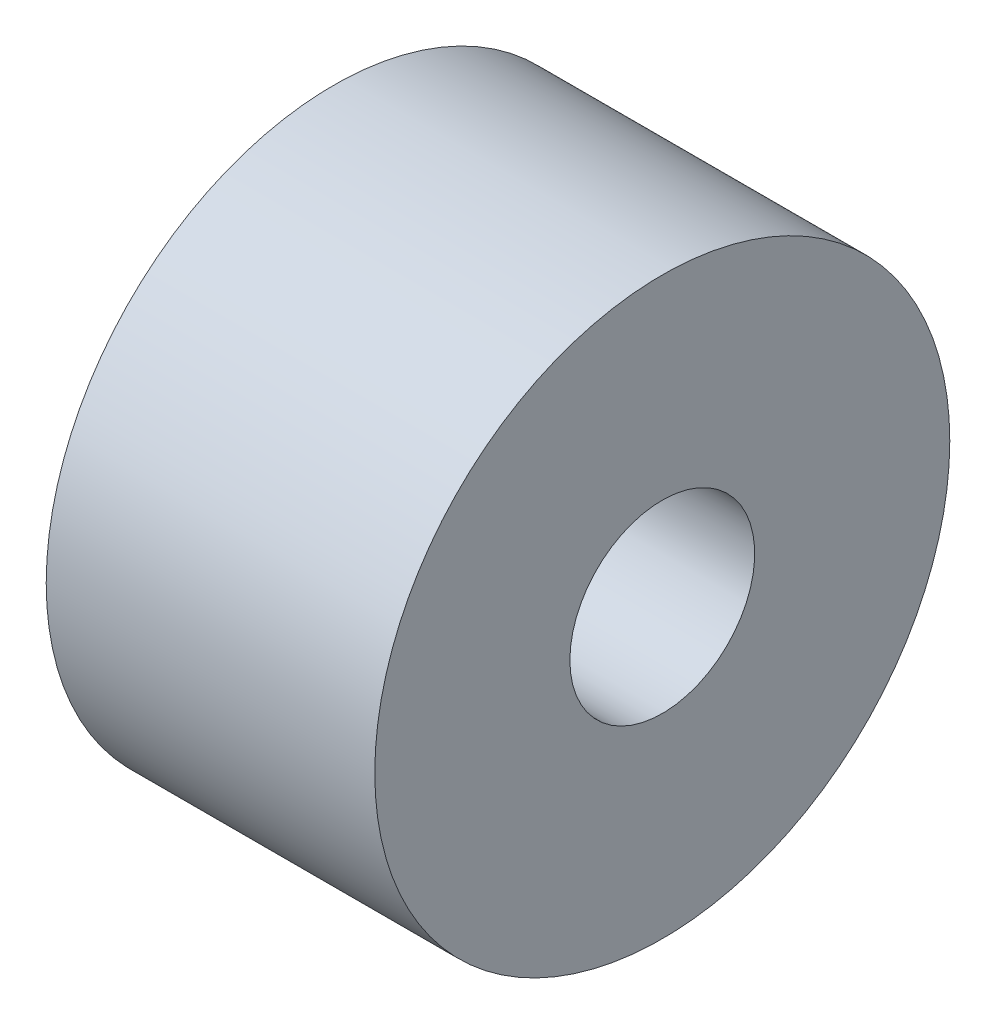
ISO-10303-21;
HEADER;
FILE_DESCRIPTION(('STEP AP214'),'2;1');
FILE_NAME('part.step','',(''),(''),'','','');
FILE_SCHEMA(('AUTOMOTIVE_DESIGN { 1 0 10303 214 1 1 1 1 }'));
ENDSEC;
DATA;
#1=APPLICATION_CONTEXT('core data for automotive mechanical design processes');
#2=APPLICATION_PROTOCOL_DEFINITION('international standard','automotive_design',2000,#1);
#3=PRODUCT_CONTEXT('',#1,'mechanical');
#4=PRODUCT('Part','Part','',(#3));
#5=PRODUCT_RELATED_PRODUCT_CATEGORY('part','',(#4));
#6=PRODUCT_DEFINITION_FORMATION('','',#4);
#7=PRODUCT_DEFINITION_CONTEXT('part definition',#1,'design');
#8=PRODUCT_DEFINITION('design','',#6,#7);
#9=PRODUCT_DEFINITION_SHAPE('','',#8);
#10=(LENGTH_UNIT() NAMED_UNIT(*) SI_UNIT(.MILLI.,.METRE.));
#11=(NAMED_UNIT(*) PLANE_ANGLE_UNIT() SI_UNIT($,.RADIAN.));
#12=(NAMED_UNIT(*) SI_UNIT($,.STERADIAN.) SOLID_ANGLE_UNIT());
#13=UNCERTAINTY_MEASURE_WITH_UNIT(LENGTH_MEASURE(1.E-05),#10,'distance_accuracy_value','');
#14=(GEOMETRIC_REPRESENTATION_CONTEXT(3) GLOBAL_UNCERTAINTY_ASSIGNED_CONTEXT((#13)) GLOBAL_UNIT_ASSIGNED_CONTEXT((#10,
#11,#12)) REPRESENTATION_CONTEXT('',''));
#15=CARTESIAN_POINT('',(0.,0.,0.));
#16=DIRECTION('',(0.,0.,1.));
#17=DIRECTION('',(1.,0.,0.));
#18=AXIS2_PLACEMENT_3D('',#15,#16,#17);
#19=CARTESIAN_POINT('',(-33.1499999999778,9.50000000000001,24.5262794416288));
#20=DIRECTION('',(-1.,0.,0.));
#21=DIRECTION('',(0.,0.,1.));
#22=AXIS2_PLACEMENT_3D('',#19,#20,#21);
#23=CONICAL_SURFACE('',#22,0.837599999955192,1.02974425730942);
#24=CARTESIAN_POINT('',(-32.6467191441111,9.50000000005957,24.5262794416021));
#25=VERTEX_POINT('',#24);
#26=VERTEX_LOOP('',#25);
#27=FACE_BOUND('',#26,.T.);
#28=CARTESIAN_POINT('',(-33.15,9.50000000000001,24.5262794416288));
#29=DIRECTION('',(1.,0.,0.));
#30=DIRECTION('',(0.,0.,-1.));
#31=AXIS2_PLACEMENT_3D('',#28,#29,#30);
#32=CIRCLE('',#31,0.8376);
#33=CARTESIAN_POINT('',(-33.15,9.50000000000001,23.6886794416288));
#34=VERTEX_POINT('',#33);
#35=EDGE_CURVE('E50',#34,#34,#32,.F.);
#36=ORIENTED_EDGE('',*,*,#35,.T.);
#37=EDGE_LOOP('',(#36));
#38=FACE_BOUND('',#37,.T.);
#39=ADVANCED_FACE('F17',(#27,#38),#23,.F.);
#40=CARTESIAN_POINT('',(-33.1499999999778,20.5,24.5262794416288));
#41=DIRECTION('',(-1.,0.,0.));
#42=DIRECTION('',(0.,0.,1.));
#43=AXIS2_PLACEMENT_3D('',#40,#41,#42);
#44=CONICAL_SURFACE('',#43,0.837599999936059,1.02974425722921);
#45=CARTESIAN_POINT('',(-32.6467191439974,20.5000000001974,24.5262794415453));
#46=VERTEX_POINT('',#45);
#47=VERTEX_LOOP('',#46);
#48=FACE_BOUND('',#47,.T.);
#49=CARTESIAN_POINT('',(-33.15,20.5,24.5262794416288));
#50=DIRECTION('',(1.,0.,0.));
#51=DIRECTION('',(0.,0.,-1.));
#52=AXIS2_PLACEMENT_3D('',#49,#50,#51);
#53=CIRCLE('',#52,0.8376);
#54=CARTESIAN_POINT('',(-33.15,20.5,23.6886794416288));
#55=VERTEX_POINT('',#54);
#56=EDGE_CURVE('E52',#55,#55,#53,.F.);
#57=ORIENTED_EDGE('',*,*,#56,.T.);
#58=EDGE_LOOP('',(#57));
#59=FACE_BOUND('',#58,.T.);
#60=ADVANCED_FACE('F47',(#48,#59),#44,.F.);
#61=CARTESIAN_POINT('',(-33.1499999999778,26.,15.));
#62=DIRECTION('',(-1.,0.,0.));
#63=DIRECTION('',(0.,0.,1.));
#64=AXIS2_PLACEMENT_3D('',#61,#62,#63);
#65=CONICAL_SURFACE('',#64,0.837599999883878,1.02974425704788);
#66=CARTESIAN_POINT('',(-32.6467191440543,26.,14.9999999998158));
#67=VERTEX_POINT('',#66);
#68=VERTEX_LOOP('',#67);
#69=FACE_BOUND('',#68,.T.);
#70=CARTESIAN_POINT('',(-33.15,26.,15.));
#71=DIRECTION('',(1.,0.,0.));
#72=DIRECTION('',(0.,0.,-1.));
#73=AXIS2_PLACEMENT_3D('',#70,#71,#72);
#74=CIRCLE('',#73,0.8376);
#75=CARTESIAN_POINT('',(-33.15,26.,14.1624));
#76=VERTEX_POINT('',#75);
#77=EDGE_CURVE('E55',#76,#76,#74,.F.);
#78=ORIENTED_EDGE('',*,*,#77,.T.);
#79=EDGE_LOOP('',(#78));
#80=FACE_BOUND('',#79,.T.);
#81=ADVANCED_FACE('F115',(#69,#80),#65,.F.);
#82=CARTESIAN_POINT('',(-33.1499999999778,20.5,5.47372055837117));
#83=DIRECTION('',(-1.,0.,0.));
#84=DIRECTION('',(0.,0.,1.));
#85=AXIS2_PLACEMENT_3D('',#82,#83,#84);
#86=CONICAL_SURFACE('',#85,0.837599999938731,1.02974425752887);
#87=CARTESIAN_POINT('',(-32.6467191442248,20.5000000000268,5.47372055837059));
#88=VERTEX_POINT('',#87);
#89=VERTEX_LOOP('',#88);
#90=FACE_BOUND('',#89,.T.);
#91=CARTESIAN_POINT('',(-33.15,20.5,5.47372055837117));
#92=DIRECTION('',(1.,0.,0.));
#93=DIRECTION('',(0.,0.,-1.));
#94=AXIS2_PLACEMENT_3D('',#91,#92,#93);
#95=CIRCLE('',#94,0.8376);
#96=CARTESIAN_POINT('',(-33.15,20.5,4.63612055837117));
#97=VERTEX_POINT('',#96);
#98=EDGE_CURVE('E99',#97,#97,#95,.F.);
#99=ORIENTED_EDGE('',*,*,#98,.T.);
#100=EDGE_LOOP('',(#99));
#101=FACE_BOUND('',#100,.T.);
#102=ADVANCED_FACE('F170',(#90,#101),#86,.F.);
#103=CARTESIAN_POINT('',(-33.1499999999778,9.5,5.47372055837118));
#104=DIRECTION('',(-1.,0.,0.));
#105=DIRECTION('',(0.,0.,1.));
#106=AXIS2_PLACEMENT_3D('',#103,#104,#105);
#107=CONICAL_SURFACE('',#106,0.837599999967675,1.02974425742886);
#108=CARTESIAN_POINT('',(-32.6467191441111,9.50000000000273,5.47372055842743));
#109=VERTEX_POINT('',#108);
#110=VERTEX_LOOP('',#109);
#111=FACE_BOUND('',#110,.T.);
#112=CARTESIAN_POINT('',(-33.15,9.5,5.47372055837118));
#113=DIRECTION('',(1.,0.,0.));
#114=DIRECTION('',(0.,0.,-1.));
#115=AXIS2_PLACEMENT_3D('',#112,#113,#114);
#116=CIRCLE('',#115,0.8376);
#117=CARTESIAN_POINT('',(-33.15,9.5,4.63612055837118));
#118=VERTEX_POINT('',#117);
#119=EDGE_CURVE('E94',#118,#118,#116,.F.);
#120=ORIENTED_EDGE('',*,*,#119,.T.);
#121=EDGE_LOOP('',(#120));
#122=FACE_BOUND('',#121,.T.);
#123=ADVANCED_FACE('F167',(#111,#122),#107,.F.);
#124=CARTESIAN_POINT('',(-33.1499999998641,4.,15.));
#125=DIRECTION('',(-1.,0.,0.));
#126=DIRECTION('',(0.,0.,1.));
#127=AXIS2_PLACEMENT_3D('',#124,#125,#126);
#128=CONICAL_SURFACE('',#127,0.837599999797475,1.02974425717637);
#129=CARTESIAN_POINT('',(-32.6467191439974,4.,15.0000000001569));
#130=VERTEX_POINT('',#129);
#131=VERTEX_LOOP('',#130);
#132=FACE_BOUND('',#131,.T.);
#133=CARTESIAN_POINT('',(-33.15,4.,15.));
#134=DIRECTION('',(1.,0.,0.));
#135=DIRECTION('',(0.,0.,-1.));
#136=AXIS2_PLACEMENT_3D('',#133,#134,#135);
#137=CIRCLE('',#136,0.8376);
#138=CARTESIAN_POINT('',(-33.15,4.,14.1624));
#139=VERTEX_POINT('',#138);
#140=EDGE_CURVE('E90',#139,#139,#137,.F.);
#141=ORIENTED_EDGE('',*,*,#140,.T.);
#142=EDGE_LOOP('',(#141));
#143=FACE_BOUND('',#142,.T.);
#144=ADVANCED_FACE('F169',(#132,#143),#128,.F.);
#145=CARTESIAN_POINT('',(-37.15,15.,15.));
#146=DIRECTION('',(1.,0.,0.));
#147=DIRECTION('',(0.,0.,-1.));
#148=AXIS2_PLACEMENT_3D('',#145,#146,#147);
#149=PLANE('',#148);
#150=CARTESIAN_POINT('',(-37.15,15.,15.));
#151=DIRECTION('',(-1.,0.,0.));
#152=DIRECTION('',(0.,0.,1.));
#153=AXIS2_PLACEMENT_3D('',#150,#151,#152);
#154=CIRCLE('',#153,4.5);
#155=CARTESIAN_POINT('',(-37.15,15.,19.5));
#156=VERTEX_POINT('',#155);
#157=EDGE_CURVE('E20',#156,#156,#154,.F.);
#158=ORIENTED_EDGE('',*,*,#157,.T.);
#159=EDGE_LOOP('',(#158));
#160=FACE_BOUND('',#159,.T.);
#161=CARTESIAN_POINT('',(-37.15,15.,15.));
#162=DIRECTION('',(1.,0.,0.));
#163=DIRECTION('',(0.,0.,-1.));
#164=AXIS2_PLACEMENT_3D('',#161,#162,#163);
#165=CIRCLE('',#164,8.);
#166=CARTESIAN_POINT('',(-37.15,15.,7.));
#167=VERTEX_POINT('',#166);
#168=EDGE_CURVE('E88',#167,#167,#165,.F.);
#169=ORIENTED_EDGE('',*,*,#168,.T.);
#170=EDGE_LOOP('',(#169));
#171=FACE_BOUND('',#170,.T.);
#172=ADVANCED_FACE('F177',(#160,#171),#149,.F.);
#173=CARTESIAN_POINT('',(-22.15,15.,15.));
#174=DIRECTION('',(-1.,0.,0.));
#175=DIRECTION('',(0.,0.,1.));
#176=AXIS2_PLACEMENT_3D('',#173,#174,#175);
#177=CYLINDRICAL_SURFACE('',#176,4.5);
#178=CARTESIAN_POINT('',(-22.15,15.,15.));
#179=DIRECTION('',(-1.,0.,0.));
#180=DIRECTION('',(0.,0.,1.));
#181=AXIS2_PLACEMENT_3D('',#178,#179,#180);
#182=CIRCLE('',#181,4.5);
#183=CARTESIAN_POINT('',(-22.15,15.,19.5));
#184=VERTEX_POINT('',#183);
#185=EDGE_CURVE('E86',#184,#184,#182,.T.);
#186=ORIENTED_EDGE('',*,*,#185,.F.);
#187=EDGE_LOOP('',(#186));
#188=FACE_BOUND('',#187,.T.);
#189=ORIENTED_EDGE('',*,*,#157,.F.);
#190=EDGE_LOOP('',(#189));
#191=FACE_BOUND('',#190,.T.);
#192=ADVANCED_FACE('F219',(#188,#191),#177,.F.);
#193=CARTESIAN_POINT('',(-38.15,9.50000000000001,24.5262794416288));
#194=DIRECTION('',(1.,0.,0.));
#195=DIRECTION('',(0.,0.,-1.));
#196=AXIS2_PLACEMENT_3D('',#193,#194,#195);
#197=CYLINDRICAL_SURFACE('',#196,0.8376);
#198=CARTESIAN_POINT('',(-38.15,9.50000000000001,24.5262794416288));
#199=DIRECTION('',(1.,0.,0.));
#200=DIRECTION('',(0.,0.,-1.));
#201=AXIS2_PLACEMENT_3D('',#198,#199,#200);
#202=CIRCLE('',#201,0.8376);
#203=CARTESIAN_POINT('',(-38.15,9.50000000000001,23.6886794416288));
#204=VERTEX_POINT('',#203);
#205=EDGE_CURVE('E83',#204,#204,#202,.T.);
#206=ORIENTED_EDGE('',*,*,#205,.F.);
#207=EDGE_LOOP('',(#206));
#208=FACE_BOUND('',#207,.T.);
#209=ORIENTED_EDGE('',*,*,#35,.F.);
#210=EDGE_LOOP('',(#209));
#211=FACE_BOUND('',#210,.T.);
#212=ADVANCED_FACE('F131',(#208,#211),#197,.F.);
#213=CARTESIAN_POINT('',(-38.15,20.5,24.5262794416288));
#214=DIRECTION('',(1.,0.,0.));
#215=DIRECTION('',(0.,0.,-1.));
#216=AXIS2_PLACEMENT_3D('',#213,#214,#215);
#217=CYLINDRICAL_SURFACE('',#216,0.8376);
#218=CARTESIAN_POINT('',(-38.15,20.5,24.5262794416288));
#219=DIRECTION('',(1.,0.,0.));
#220=DIRECTION('',(0.,0.,-1.));
#221=AXIS2_PLACEMENT_3D('',#218,#219,#220);
#222=CIRCLE('',#221,0.8376);
#223=CARTESIAN_POINT('',(-38.15,20.5,23.6886794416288));
#224=VERTEX_POINT('',#223);
#225=EDGE_CURVE('E80',#224,#224,#222,.T.);
#226=ORIENTED_EDGE('',*,*,#225,.F.);
#227=EDGE_LOOP('',(#226));
#228=FACE_BOUND('',#227,.T.);
#229=ORIENTED_EDGE('',*,*,#56,.F.);
#230=EDGE_LOOP('',(#229));
#231=FACE_BOUND('',#230,.T.);
#232=ADVANCED_FACE('F120',(#228,#231),#217,.F.);
#233=CARTESIAN_POINT('',(-38.15,26.,15.));
#234=DIRECTION('',(1.,0.,0.));
#235=DIRECTION('',(0.,0.,-1.));
#236=AXIS2_PLACEMENT_3D('',#233,#234,#235);
#237=CYLINDRICAL_SURFACE('',#236,0.8376);
#238=CARTESIAN_POINT('',(-38.15,26.,15.));
#239=DIRECTION('',(1.,0.,0.));
#240=DIRECTION('',(0.,0.,-1.));
#241=AXIS2_PLACEMENT_3D('',#238,#239,#240);
#242=CIRCLE('',#241,0.8376);
#243=CARTESIAN_POINT('',(-38.15,26.,14.1624));
#244=VERTEX_POINT('',#243);
#245=EDGE_CURVE('E77',#244,#244,#242,.T.);
#246=ORIENTED_EDGE('',*,*,#245,.F.);
#247=EDGE_LOOP('',(#246));
#248=FACE_BOUND('',#247,.T.);
#249=ORIENTED_EDGE('',*,*,#77,.F.);
#250=EDGE_LOOP('',(#249));
#251=FACE_BOUND('',#250,.T.);
#252=ADVANCED_FACE('F117',(#248,#251),#237,.F.);
#253=CARTESIAN_POINT('',(-38.15,20.5,5.47372055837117));
#254=DIRECTION('',(1.,0.,0.));
#255=DIRECTION('',(0.,0.,-1.));
#256=AXIS2_PLACEMENT_3D('',#253,#254,#255);
#257=CYLINDRICAL_SURFACE('',#256,0.8376);
#258=CARTESIAN_POINT('',(-38.15,20.5,5.47372055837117));
#259=DIRECTION('',(1.,0.,0.));
#260=DIRECTION('',(0.,0.,-1.));
#261=AXIS2_PLACEMENT_3D('',#258,#259,#260);
#262=CIRCLE('',#261,0.8376);
#263=CARTESIAN_POINT('',(-38.15,20.5,4.63612055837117));
#264=VERTEX_POINT('',#263);
#265=EDGE_CURVE('E74',#264,#264,#262,.T.);
#266=ORIENTED_EDGE('',*,*,#265,.F.);
#267=EDGE_LOOP('',(#266));
#268=FACE_BOUND('',#267,.T.);
#269=ORIENTED_EDGE('',*,*,#98,.F.);
#270=EDGE_LOOP('',(#269));
#271=FACE_BOUND('',#270,.T.);
#272=ADVANCED_FACE('F119',(#268,#271),#257,.F.);
#273=CARTESIAN_POINT('',(-38.15,9.5,5.47372055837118));
#274=DIRECTION('',(1.,0.,0.));
#275=DIRECTION('',(0.,0.,-1.));
#276=AXIS2_PLACEMENT_3D('',#273,#274,#275);
#277=CYLINDRICAL_SURFACE('',#276,0.8376);
#278=CARTESIAN_POINT('',(-38.15,9.5,5.47372055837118));
#279=DIRECTION('',(1.,0.,0.));
#280=DIRECTION('',(0.,0.,-1.));
#281=AXIS2_PLACEMENT_3D('',#278,#279,#280);
#282=CIRCLE('',#281,0.8376);
#283=CARTESIAN_POINT('',(-38.15,9.5,4.63612055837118));
#284=VERTEX_POINT('',#283);
#285=EDGE_CURVE('E71',#284,#284,#282,.T.);
#286=ORIENTED_EDGE('',*,*,#285,.F.);
#287=EDGE_LOOP('',(#286));
#288=FACE_BOUND('',#287,.T.);
#289=ORIENTED_EDGE('',*,*,#119,.F.);
#290=EDGE_LOOP('',(#289));
#291=FACE_BOUND('',#290,.T.);
#292=ADVANCED_FACE('F128',(#288,#291),#277,.F.);
#293=CARTESIAN_POINT('',(-38.15,4.,15.));
#294=DIRECTION('',(1.,0.,0.));
#295=DIRECTION('',(0.,0.,-1.));
#296=AXIS2_PLACEMENT_3D('',#293,#294,#295);
#297=CYLINDRICAL_SURFACE('',#296,0.8376);
#298=CARTESIAN_POINT('',(-38.15,4.,15.));
#299=DIRECTION('',(1.,0.,0.));
#300=DIRECTION('',(0.,0.,-1.));
#301=AXIS2_PLACEMENT_3D('',#298,#299,#300);
#302=CIRCLE('',#301,0.8376);
#303=CARTESIAN_POINT('',(-38.15,4.,14.1624));
#304=VERTEX_POINT('',#303);
#305=EDGE_CURVE('E68',#304,#304,#302,.T.);
#306=ORIENTED_EDGE('',*,*,#305,.F.);
#307=EDGE_LOOP('',(#306));
#308=FACE_BOUND('',#307,.T.);
#309=ORIENTED_EDGE('',*,*,#140,.F.);
#310=EDGE_LOOP('',(#309));
#311=FACE_BOUND('',#310,.T.);
#312=ADVANCED_FACE('F154',(#308,#311),#297,.F.);
#313=CARTESIAN_POINT('',(-38.15,15.,15.));
#314=DIRECTION('',(1.,0.,0.));
#315=DIRECTION('',(0.,0.,-1.));
#316=AXIS2_PLACEMENT_3D('',#313,#314,#315);
#317=CYLINDRICAL_SURFACE('',#316,8.);
#318=CARTESIAN_POINT('',(-38.15,15.,15.));
#319=DIRECTION('',(1.,0.,0.));
#320=DIRECTION('',(0.,0.,-1.));
#321=AXIS2_PLACEMENT_3D('',#318,#319,#320);
#322=CIRCLE('',#321,8.);
#323=CARTESIAN_POINT('',(-38.15,15.,7.));
#324=VERTEX_POINT('',#323);
#325=EDGE_CURVE('E65',#324,#324,#322,.T.);
#326=ORIENTED_EDGE('',*,*,#325,.F.);
#327=EDGE_LOOP('',(#326));
#328=FACE_BOUND('',#327,.T.);
#329=ORIENTED_EDGE('',*,*,#168,.F.);
#330=EDGE_LOOP('',(#329));
#331=FACE_BOUND('',#330,.T.);
#332=ADVANCED_FACE('F150',(#328,#331),#317,.F.);
#333=CARTESIAN_POINT('',(-22.15,15.,15.));
#334=DIRECTION('',(1.,0.,0.));
#335=DIRECTION('',(0.,0.,-1.));
#336=AXIS2_PLACEMENT_3D('',#333,#334,#335);
#337=PLANE('',#336);
#338=CARTESIAN_POINT('',(-22.15,15.,15.));
#339=DIRECTION('',(1.,0.,0.));
#340=DIRECTION('',(0.,0.,-1.));
#341=AXIS2_PLACEMENT_3D('',#338,#339,#340);
#342=CIRCLE('',#341,14.);
#343=CARTESIAN_POINT('',(-22.15,15.,0.999999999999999));
#344=VERTEX_POINT('',#343);
#345=EDGE_CURVE('E26',#344,#344,#342,.F.);
#346=ORIENTED_EDGE('',*,*,#345,.F.);
#347=EDGE_LOOP('',(#346));
#348=FACE_BOUND('',#347,.T.);
#349=ORIENTED_EDGE('',*,*,#185,.T.);
#350=EDGE_LOOP('',(#349));
#351=FACE_BOUND('',#350,.T.);
#352=ADVANCED_FACE('F143',(#348,#351),#337,.T.);
#353=CARTESIAN_POINT('',(-38.15,15.,15.));
#354=DIRECTION('',(-1.,0.,0.));
#355=DIRECTION('',(0.,0.,1.));
#356=AXIS2_PLACEMENT_3D('',#353,#354,#355);
#357=PLANE('',#356);
#358=CARTESIAN_POINT('',(-38.15,15.,15.));
#359=DIRECTION('',(1.,0.,0.));
#360=DIRECTION('',(0.,0.,-1.));
#361=AXIS2_PLACEMENT_3D('',#358,#359,#360);
#362=CIRCLE('',#361,14.);
#363=CARTESIAN_POINT('',(-38.15,15.,0.999999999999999));
#364=VERTEX_POINT('',#363);
#365=EDGE_CURVE('E11',#364,#364,#362,.T.);
#366=ORIENTED_EDGE('',*,*,#365,.F.);
#367=EDGE_LOOP('',(#366));
#368=FACE_BOUND('',#367,.T.);
#369=ORIENTED_EDGE('',*,*,#325,.T.);
#370=EDGE_LOOP('',(#369));
#371=FACE_BOUND('',#370,.T.);
#372=ORIENTED_EDGE('',*,*,#305,.T.);
#373=EDGE_LOOP('',(#372));
#374=FACE_BOUND('',#373,.T.);
#375=ORIENTED_EDGE('',*,*,#285,.T.);
#376=EDGE_LOOP('',(#375));
#377=FACE_BOUND('',#376,.T.);
#378=ORIENTED_EDGE('',*,*,#265,.T.);
#379=EDGE_LOOP('',(#378));
#380=FACE_BOUND('',#379,.T.);
#381=ORIENTED_EDGE('',*,*,#245,.T.);
#382=EDGE_LOOP('',(#381));
#383=FACE_BOUND('',#382,.T.);
#384=ORIENTED_EDGE('',*,*,#225,.T.);
#385=EDGE_LOOP('',(#384));
#386=FACE_BOUND('',#385,.T.);
#387=ORIENTED_EDGE('',*,*,#205,.T.);
#388=EDGE_LOOP('',(#387));
#389=FACE_BOUND('',#388,.T.);
#390=ADVANCED_FACE('F137',(#368,#371,#374,#377,#380,#383,#386,#389),#357,.T.);
#391=CARTESIAN_POINT('',(-38.15,15.,15.));
#392=DIRECTION('',(1.,0.,0.));
#393=DIRECTION('',(0.,0.,-1.));
#394=AXIS2_PLACEMENT_3D('',#391,#392,#393);
#395=CYLINDRICAL_SURFACE('',#394,14.);
#396=ORIENTED_EDGE('',*,*,#365,.T.);
#397=EDGE_LOOP('',(#396));
#398=FACE_BOUND('',#397,.T.);
#399=ORIENTED_EDGE('',*,*,#345,.T.);
#400=EDGE_LOOP('',(#399));
#401=FACE_BOUND('',#400,.T.);
#402=ADVANCED_FACE('F135',(#398,#401),#395,.T.);
#403=CLOSED_SHELL('',(#39,#60,#81,#102,#123,#144,#172,#192,#212,#232,#252,#272,#292,#312,#332,
#352,#390,#402));
#404=MANIFOLD_SOLID_BREP('B1',#403);
#405=ADVANCED_BREP_SHAPE_REPRESENTATION('',(#18,#404),#14);
#406=SHAPE_DEFINITION_REPRESENTATION(#9,#405);
ENDSEC;
END-ISO-10303-21;
